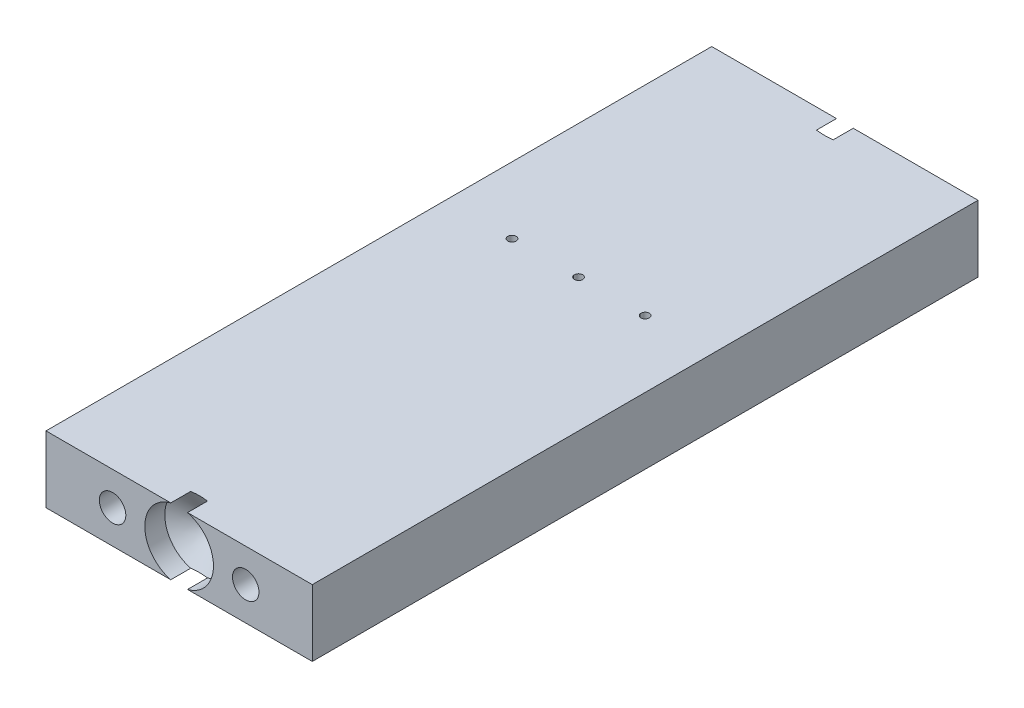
from build123d import *

# Parameters (mm, degrees)
SKETCH1_W                            = 50.8
SKETCH1_H                            = 127
BOSS_EXTRUDE1_DEPTH                  = 12.7
F_1_16_0_0625_DIAMETER_HOLE1_D       = 1.5875
F_8_0_199_DIAMETER_HOLE1_D           = 5.0546
F_8_0_199_DIAMETER_HOLE1_DEPTH       = 10.0000054
F_8_0_199_DIAMETER_HOLE1_TIP         = 1.518555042
F_8_0_199_DIAMETER_HOLE2_D           = 5.0546
F_8_0_199_DIAMETER_HOLE2_DEPTH       = 10.0000054
F_8_0_199_DIAMETER_HOLE2_TIP         = 1.518555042
F_33_64_0_51563_DIAMETER_HOLE1_D     = 13.097002
F_33_64_0_51563_DIAMETER_HOLE1_DEPTH = 3.81
F_33_64_0_51563_DIAMETER_HOLE1_TIP   = 3.934736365
F_33_64_0_51563_DIAMETER_HOLE2_D     = 13.097002
F_33_64_0_51563_DIAMETER_HOLE2_DEPTH = 3.81
F_33_64_0_51563_DIAMETER_HOLE2_TIP   = 3.934736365


with BuildPart() as part:
    # Sketch1 → Boss-Extrude1 (new body)
    with BuildSketch(Plane(origin=(0, 0, 0), x_dir=(1, 0, 0), z_dir=(0, 1, 0))):
        Rectangle(SKETCH1_W, SKETCH1_H)
    extrude(amount=BOSS_EXTRUDE1_DEPTH)

    # 1_16 _0.0625_ Diameter Hole1 (through all)
    with Locations(Plane(origin=(0, 12.7, 0), x_dir=(1, 0, 0), z_dir=(0, 1, 0))):
        with Locations((0, 12.7), (12.7, 12.7), (-12.7, 12.7)):
            Hole(F_1_16_0_0625_DIAMETER_HOLE1_D / 2)

    # 8 _0.199_ Diameter Hole1
    with Locations(Plane.XY.offset(63.5)):
        with Locations((-12.7, 6.35), (12.7, 6.35)):
            Hole(F_8_0_199_DIAMETER_HOLE1_D / 2, depth=F_8_0_199_DIAMETER_HOLE1_DEPTH)
            with Locations((0, 0, -(F_8_0_199_DIAMETER_HOLE1_DEPTH + F_8_0_199_DIAMETER_HOLE1_TIP / 2))):  # 118° drill point
                Cone(0, F_8_0_199_DIAMETER_HOLE1_D / 2, F_8_0_199_DIAMETER_HOLE1_TIP, mode=Mode.SUBTRACT)

    # 8 _0.199_ Diameter Hole2
    with Locations(Plane(origin=(0, 0, -63.5), x_dir=(-1, 0, 0), z_dir=(0, 0, -1))):
        with Locations((-12.7, 6.35), (12.7, 6.35)):
            Hole(F_8_0_199_DIAMETER_HOLE2_D / 2, depth=F_8_0_199_DIAMETER_HOLE2_DEPTH)
            with Locations((0, 0, -(F_8_0_199_DIAMETER_HOLE2_DEPTH + F_8_0_199_DIAMETER_HOLE2_TIP / 2))):  # 118° drill point
                Cone(0, F_8_0_199_DIAMETER_HOLE2_D / 2, F_8_0_199_DIAMETER_HOLE2_TIP, mode=Mode.SUBTRACT)

    # 33_64 _0.51563_ Diameter Hole1
    with Locations(Plane.XY.offset(63.5)):
        with Locations((0, 6.35)):
            Hole(F_33_64_0_51563_DIAMETER_HOLE1_D / 2, depth=F_33_64_0_51563_DIAMETER_HOLE1_DEPTH)
            with Locations((0, 0, -(F_33_64_0_51563_DIAMETER_HOLE1_DEPTH + F_33_64_0_51563_DIAMETER_HOLE1_TIP / 2))):  # 118° drill point
                Cone(0, F_33_64_0_51563_DIAMETER_HOLE1_D / 2, F_33_64_0_51563_DIAMETER_HOLE1_TIP, mode=Mode.SUBTRACT)

    # 33_64 _0.51563_ Diameter Hole2
    with Locations(Plane(origin=(0, 0, -63.5), x_dir=(-1, 0, 0), z_dir=(0, 0, -1))):
        with Locations((0, 6.35)):
            Hole(F_33_64_0_51563_DIAMETER_HOLE2_D / 2, depth=F_33_64_0_51563_DIAMETER_HOLE2_DEPTH)
            with Locations((0, 0, -(F_33_64_0_51563_DIAMETER_HOLE2_DEPTH + F_33_64_0_51563_DIAMETER_HOLE2_TIP / 2))):  # 118° drill point
                Cone(0, F_33_64_0_51563_DIAMETER_HOLE2_D / 2, F_33_64_0_51563_DIAMETER_HOLE2_TIP, mode=Mode.SUBTRACT)


solid = part.part
